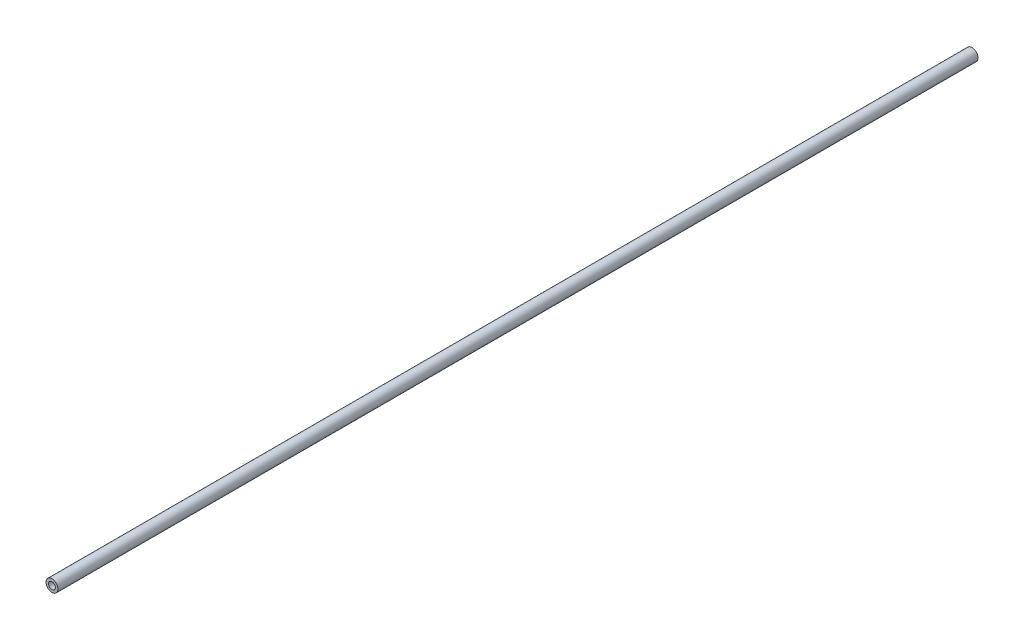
ISO-10303-21;
HEADER;
FILE_DESCRIPTION(('STEP AP214'),'2;1');
FILE_NAME('part.step','',(''),(''),'','','');
FILE_SCHEMA(('AUTOMOTIVE_DESIGN { 1 0 10303 214 1 1 1 1 }'));
ENDSEC;
DATA;
#1=APPLICATION_CONTEXT('core data for automotive mechanical design processes');
#2=APPLICATION_PROTOCOL_DEFINITION('international standard','automotive_design',2000,#1);
#3=PRODUCT_CONTEXT('',#1,'mechanical');
#4=PRODUCT('Part','Part','',(#3));
#5=PRODUCT_RELATED_PRODUCT_CATEGORY('part','',(#4));
#6=PRODUCT_DEFINITION_FORMATION('','',#4);
#7=PRODUCT_DEFINITION_CONTEXT('part definition',#1,'design');
#8=PRODUCT_DEFINITION('design','',#6,#7);
#9=PRODUCT_DEFINITION_SHAPE('','',#8);
#10=(LENGTH_UNIT() NAMED_UNIT(*) SI_UNIT(.MILLI.,.METRE.));
#11=(NAMED_UNIT(*) PLANE_ANGLE_UNIT() SI_UNIT($,.RADIAN.));
#12=(NAMED_UNIT(*) SI_UNIT($,.STERADIAN.) SOLID_ANGLE_UNIT());
#13=UNCERTAINTY_MEASURE_WITH_UNIT(LENGTH_MEASURE(1.E-05),#10,'distance_accuracy_value','');
#14=(GEOMETRIC_REPRESENTATION_CONTEXT(3) GLOBAL_UNCERTAINTY_ASSIGNED_CONTEXT((#13)) GLOBAL_UNIT_ASSIGNED_CONTEXT((#10,
#11,#12)) REPRESENTATION_CONTEXT('',''));
#15=CARTESIAN_POINT('',(0.,0.,0.));
#16=DIRECTION('',(0.,0.,1.));
#17=DIRECTION('',(1.,0.,0.));
#18=AXIS2_PLACEMENT_3D('',#15,#16,#17);
#19=CARTESIAN_POINT('',(0.,0.,462.5));
#20=DIRECTION('',(0.,0.,-1.));
#21=DIRECTION('',(-1.,0.,0.));
#22=AXIS2_PLACEMENT_3D('',#19,#20,#21);
#23=CYLINDRICAL_SURFACE('',#22,6.);
#24=CARTESIAN_POINT('',(0.,0.,462.5));
#25=DIRECTION('',(0.,0.,1.));
#26=DIRECTION('',(1.,0.,0.));
#27=AXIS2_PLACEMENT_3D('',#24,#25,#26);
#28=CIRCLE('',#27,6.);
#29=CARTESIAN_POINT('',(-6.00000000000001,0.,462.5));
#30=VERTEX_POINT('',#29);
#31=EDGE_CURVE('E11',#30,#30,#28,.T.);
#32=CARTESIAN_POINT('',(0.,0.,-462.5));
#33=DIRECTION('',(0.,0.,1.));
#34=DIRECTION('',(1.,0.,0.));
#35=AXIS2_PLACEMENT_3D('',#32,#33,#34);
#36=CIRCLE('',#35,6.);
#37=CARTESIAN_POINT('',(-6.00000000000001,0.,-462.5));
#38=VERTEX_POINT('',#37);
#39=EDGE_CURVE('E50',#38,#38,#36,.T.);
#40=CARTESIAN_POINT('',(-6.00000000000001,0.,462.5));
#41=CARTESIAN_POINT('',(-6.00000000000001,0.,452.864583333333));
#42=CARTESIAN_POINT('',(-6.00000000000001,0.,443.229166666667));
#43=CARTESIAN_POINT('',(-6.00000000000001,0.,423.958333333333));
#44=CARTESIAN_POINT('',(-6.00000000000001,0.,414.322916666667));
#45=CARTESIAN_POINT('',(-6.00000000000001,0.,395.052083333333));
#46=CARTESIAN_POINT('',(-6.00000000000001,0.,385.416666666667));
#47=CARTESIAN_POINT('',(-6.00000000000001,0.,366.145833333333));
#48=CARTESIAN_POINT('',(-6.00000000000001,0.,356.510416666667));
#49=CARTESIAN_POINT('',(-6.00000000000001,0.,337.239583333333));
#50=CARTESIAN_POINT('',(-6.00000000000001,0.,327.604166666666));
#51=CARTESIAN_POINT('',(-6.00000000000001,0.,308.333333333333));
#52=CARTESIAN_POINT('',(-6.00000000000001,0.,298.697916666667));
#53=CARTESIAN_POINT('',(-6.00000000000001,0.,279.427083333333));
#54=CARTESIAN_POINT('',(-6.00000000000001,0.,269.791666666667));
#55=CARTESIAN_POINT('',(-6.00000000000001,0.,250.520833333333));
#56=CARTESIAN_POINT('',(-6.00000000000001,0.,240.885416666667));
#57=CARTESIAN_POINT('',(-6.00000000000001,0.,221.614583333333));
#58=CARTESIAN_POINT('',(-6.00000000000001,0.,211.979166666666));
#59=CARTESIAN_POINT('',(-6.00000000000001,0.,192.708333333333));
#60=CARTESIAN_POINT('',(-6.00000000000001,0.,183.072916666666));
#61=CARTESIAN_POINT('',(-6.00000000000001,0.,163.802083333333));
#62=CARTESIAN_POINT('',(-6.00000000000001,0.,154.166666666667));
#63=CARTESIAN_POINT('',(-6.00000000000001,0.,134.895833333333));
#64=CARTESIAN_POINT('',(-6.00000000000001,0.,125.260416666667));
#65=CARTESIAN_POINT('',(-6.00000000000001,0.,105.989583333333));
#66=CARTESIAN_POINT('',(-6.00000000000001,0.,96.3541666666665));
#67=CARTESIAN_POINT('',(-6.00000000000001,0.,77.0833333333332));
#68=CARTESIAN_POINT('',(-6.00000000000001,0.,67.4479166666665));
#69=CARTESIAN_POINT('',(-6.00000000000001,0.,48.1770833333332));
#70=CARTESIAN_POINT('',(-6.00000000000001,0.,38.5416666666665));
#71=CARTESIAN_POINT('',(-6.00000000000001,0.,19.2708333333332));
#72=CARTESIAN_POINT('',(-6.00000000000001,0.,9.63541666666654));
#73=CARTESIAN_POINT('',(-6.00000000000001,0.,-9.63541666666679));
#74=CARTESIAN_POINT('',(-6.00000000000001,0.,-19.2708333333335));
#75=CARTESIAN_POINT('',(-6.00000000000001,0.,-38.5416666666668));
#76=CARTESIAN_POINT('',(-6.00000000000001,0.,-48.1770833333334));
#77=CARTESIAN_POINT('',(-6.00000000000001,0.,-67.4479166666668));
#78=CARTESIAN_POINT('',(-6.00000000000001,0.,-77.0833333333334));
#79=CARTESIAN_POINT('',(-6.00000000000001,0.,-96.3541666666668));
#80=CARTESIAN_POINT('',(-6.00000000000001,0.,-105.989583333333));
#81=CARTESIAN_POINT('',(-6.00000000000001,0.,-125.260416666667));
#82=CARTESIAN_POINT('',(-6.00000000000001,0.,-134.895833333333));
#83=CARTESIAN_POINT('',(-6.00000000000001,0.,-154.166666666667));
#84=CARTESIAN_POINT('',(-6.00000000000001,0.,-163.802083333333));
#85=CARTESIAN_POINT('',(-6.00000000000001,0.,-183.072916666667));
#86=CARTESIAN_POINT('',(-6.00000000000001,0.,-192.708333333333));
#87=CARTESIAN_POINT('',(-6.00000000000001,0.,-211.979166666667));
#88=CARTESIAN_POINT('',(-6.00000000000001,0.,-221.614583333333));
#89=CARTESIAN_POINT('',(-6.00000000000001,0.,-240.885416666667));
#90=CARTESIAN_POINT('',(-6.00000000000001,0.,-250.520833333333));
#91=CARTESIAN_POINT('',(-6.00000000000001,0.,-269.791666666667));
#92=CARTESIAN_POINT('',(-6.00000000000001,0.,-279.427083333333));
#93=CARTESIAN_POINT('',(-6.00000000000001,0.,-298.697916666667));
#94=CARTESIAN_POINT('',(-6.00000000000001,0.,-308.333333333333));
#95=CARTESIAN_POINT('',(-6.00000000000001,0.,-327.604166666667));
#96=CARTESIAN_POINT('',(-6.00000000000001,0.,-337.239583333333));
#97=CARTESIAN_POINT('',(-6.00000000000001,0.,-356.510416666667));
#98=CARTESIAN_POINT('',(-6.00000000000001,0.,-366.145833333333));
#99=CARTESIAN_POINT('',(-6.00000000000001,0.,-385.416666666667));
#100=CARTESIAN_POINT('',(-6.00000000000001,0.,-395.052083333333));
#101=CARTESIAN_POINT('',(-6.00000000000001,0.,-414.322916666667));
#102=CARTESIAN_POINT('',(-6.00000000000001,0.,-423.958333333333));
#103=CARTESIAN_POINT('',(-6.00000000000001,0.,-443.229166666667));
#104=CARTESIAN_POINT('',(-6.00000000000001,0.,-452.864583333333));
#105=CARTESIAN_POINT('',(-6.00000000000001,0.,-462.5));
#106=B_SPLINE_CURVE_WITH_KNOTS('',3,(#40,#41,#42,#43,#44,#45,#46,#47,#48,#49,#50,#51,#52,#53,
#54,#55,#56,#57,#58,#59,#60,#61,#62,#63,#64,#65,#66,#67,#68,#69,#70,#71,#72,#73,#74,#75,#76,#77,
#78,#79,#80,#81,#82,#83,#84,#85,#86,#87,#88,#89,#90,#91,#92,#93,#94,#95,#96,#97,#98,#99,#100,
#101,#102,#103,#104,#105),.UNSPECIFIED.,.F.,.F.,(4,2,2,2,2,2,2,2,2,2,2,2,2,2,2,2,2,2,2,2,2,2,2,
2,2,2,2,2,2,2,2,2,4),(0.,28.90625,57.8124999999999,86.71875,115.625,144.53125,173.4375,
202.34375,231.25,260.15625,289.0625,317.96875,346.875,375.78125,404.6875,433.59375,462.5,
491.40625,520.3125,549.21875,578.125,607.03125,635.9375,664.84375,693.75,722.65625,751.5625,
780.46875,809.375,838.28125,867.1875,896.09375,925.),.UNSPECIFIED.);
#107=EDGE_CURVE('BSEAM42',#30,#38,#106,.T.);
#108=ORIENTED_EDGE('',*,*,#31,.F.);
#109=ORIENTED_EDGE('',*,*,#39,.T.);
#110=ORIENTED_EDGE('',*,*,#107,.T.);
#111=ORIENTED_EDGE('',*,*,#107,.F.);
#112=EDGE_LOOP('',(#108,#110,#109,#111));
#113=FACE_BOUND('',#112,.T.);
#114=ADVANCED_FACE('F42',(#113),#23,.T.);
#115=CARTESIAN_POINT('',(0.,0.,462.5));
#116=DIRECTION('',(0.,0.,1.));
#117=DIRECTION('',(1.,0.,0.));
#118=AXIS2_PLACEMENT_3D('',#115,#116,#117);
#119=PLANE('',#118);
#120=CARTESIAN_POINT('',(0.,0.,462.5));
#121=DIRECTION('',(0.,0.,1.));
#122=DIRECTION('',(1.,0.,0.));
#123=AXIS2_PLACEMENT_3D('',#120,#121,#122);
#124=CIRCLE('',#123,3.39999999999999);
#125=CARTESIAN_POINT('',(3.39999999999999,0.,462.5));
#126=VERTEX_POINT('',#125);
#127=EDGE_CURVE('E66',#126,#126,#124,.T.);
#128=ORIENTED_EDGE('',*,*,#127,.F.);
#129=EDGE_LOOP('',(#128));
#130=FACE_BOUND('',#129,.T.);
#131=ORIENTED_EDGE('',*,*,#31,.T.);
#132=EDGE_LOOP('',(#131));
#133=FACE_BOUND('',#132,.T.);
#134=ADVANCED_FACE('F87',(#130,#133),#119,.T.);
#135=CARTESIAN_POINT('',(0.,0.,-462.5));
#136=DIRECTION('',(0.,0.,1.));
#137=DIRECTION('',(1.,0.,0.));
#138=AXIS2_PLACEMENT_3D('',#135,#136,#137);
#139=PLANE('',#138);
#140=CARTESIAN_POINT('',(0.,0.,-462.5));
#141=DIRECTION('',(0.,0.,-1.));
#142=DIRECTION('',(-1.,0.,0.));
#143=AXIS2_PLACEMENT_3D('',#140,#141,#142);
#144=CIRCLE('',#143,3.39999999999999);
#145=CARTESIAN_POINT('',(-3.39999999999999,0.,-462.5));
#146=VERTEX_POINT('',#145);
#147=EDGE_CURVE('E76',#146,#146,#144,.T.);
#148=ORIENTED_EDGE('',*,*,#147,.F.);
#149=EDGE_LOOP('',(#148));
#150=FACE_BOUND('',#149,.T.);
#151=ORIENTED_EDGE('',*,*,#39,.F.);
#152=EDGE_LOOP('',(#151));
#153=FACE_BOUND('',#152,.T.);
#154=ADVANCED_FACE('F84',(#150,#153),#139,.F.);
#155=CARTESIAN_POINT('',(0.,0.,-462.5));
#156=DIRECTION('',(0.,0.,-1.));
#157=DIRECTION('',(-1.,0.,0.));
#158=AXIS2_PLACEMENT_3D('',#155,#156,#157);
#159=CYLINDRICAL_SURFACE('',#158,3.39999999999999);
#160=CARTESIAN_POINT('',(0.,0.,-442.75));
#161=DIRECTION('',(0.,0.,-1.));
#162=DIRECTION('',(-1.,0.,0.));
#163=AXIS2_PLACEMENT_3D('',#160,#161,#162);
#164=CIRCLE('',#163,3.4);
#165=CARTESIAN_POINT('',(-3.39999999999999,0.,-442.75));
#166=VERTEX_POINT('',#165);
#167=EDGE_CURVE('E71',#166,#166,#164,.T.);
#168=CARTESIAN_POINT('',(-3.39999999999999,0.,-442.75));
#169=CARTESIAN_POINT('',(-3.39999999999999,0.,-442.955729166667));
#170=CARTESIAN_POINT('',(-3.39999999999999,0.,-443.161458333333));
#171=CARTESIAN_POINT('',(-3.39999999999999,0.,-443.572916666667));
#172=CARTESIAN_POINT('',(-3.39999999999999,0.,-443.778645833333));
#173=CARTESIAN_POINT('',(-3.39999999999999,0.,-444.190104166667));
#174=CARTESIAN_POINT('',(-3.39999999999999,0.,-444.395833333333));
#175=CARTESIAN_POINT('',(-3.39999999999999,0.,-444.807291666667));
#176=CARTESIAN_POINT('',(-3.39999999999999,0.,-445.013020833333));
#177=CARTESIAN_POINT('',(-3.39999999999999,0.,-445.424479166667));
#178=CARTESIAN_POINT('',(-3.39999999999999,0.,-445.630208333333));
#179=CARTESIAN_POINT('',(-3.39999999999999,0.,-446.041666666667));
#180=CARTESIAN_POINT('',(-3.39999999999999,0.,-446.247395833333));
#181=CARTESIAN_POINT('',(-3.39999999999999,0.,-446.658854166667));
#182=CARTESIAN_POINT('',(-3.39999999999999,0.,-446.864583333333));
#183=CARTESIAN_POINT('',(-3.39999999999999,0.,-447.276041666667));
#184=CARTESIAN_POINT('',(-3.39999999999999,0.,-447.481770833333));
#185=CARTESIAN_POINT('',(-3.39999999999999,0.,-447.893229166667));
#186=CARTESIAN_POINT('',(-3.39999999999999,0.,-448.098958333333));
#187=CARTESIAN_POINT('',(-3.39999999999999,0.,-448.510416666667));
#188=CARTESIAN_POINT('',(-3.39999999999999,0.,-448.716145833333));
#189=CARTESIAN_POINT('',(-3.39999999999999,0.,-449.127604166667));
#190=CARTESIAN_POINT('',(-3.39999999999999,0.,-449.333333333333));
#191=CARTESIAN_POINT('',(-3.39999999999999,0.,-449.744791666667));
#192=CARTESIAN_POINT('',(-3.39999999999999,0.,-449.950520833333));
#193=CARTESIAN_POINT('',(-3.39999999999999,0.,-450.361979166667));
#194=CARTESIAN_POINT('',(-3.39999999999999,0.,-450.567708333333));
#195=CARTESIAN_POINT('',(-3.39999999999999,0.,-450.979166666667));
#196=CARTESIAN_POINT('',(-3.39999999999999,0.,-451.184895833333));
#197=CARTESIAN_POINT('',(-3.39999999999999,0.,-451.596354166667));
#198=CARTESIAN_POINT('',(-3.39999999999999,0.,-451.802083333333));
#199=CARTESIAN_POINT('',(-3.39999999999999,0.,-452.213541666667));
#200=CARTESIAN_POINT('',(-3.39999999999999,0.,-452.419270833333));
#201=CARTESIAN_POINT('',(-3.39999999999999,0.,-452.830729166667));
#202=CARTESIAN_POINT('',(-3.39999999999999,0.,-453.036458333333));
#203=CARTESIAN_POINT('',(-3.39999999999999,0.,-453.447916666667));
#204=CARTESIAN_POINT('',(-3.39999999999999,0.,-453.653645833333));
#205=CARTESIAN_POINT('',(-3.39999999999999,0.,-454.065104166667));
#206=CARTESIAN_POINT('',(-3.39999999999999,0.,-454.270833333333));
#207=CARTESIAN_POINT('',(-3.39999999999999,0.,-454.682291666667));
#208=CARTESIAN_POINT('',(-3.39999999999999,0.,-454.888020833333));
#209=CARTESIAN_POINT('',(-3.39999999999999,0.,-455.299479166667));
#210=CARTESIAN_POINT('',(-3.39999999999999,0.,-455.505208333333));
#211=CARTESIAN_POINT('',(-3.39999999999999,0.,-455.916666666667));
#212=CARTESIAN_POINT('',(-3.39999999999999,0.,-456.122395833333));
#213=CARTESIAN_POINT('',(-3.39999999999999,0.,-456.533854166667));
#214=CARTESIAN_POINT('',(-3.39999999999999,0.,-456.739583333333));
#215=CARTESIAN_POINT('',(-3.39999999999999,0.,-457.151041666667));
#216=CARTESIAN_POINT('',(-3.39999999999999,0.,-457.356770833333));
#217=CARTESIAN_POINT('',(-3.39999999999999,0.,-457.768229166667));
#218=CARTESIAN_POINT('',(-3.39999999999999,0.,-457.973958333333));
#219=CARTESIAN_POINT('',(-3.39999999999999,0.,-458.385416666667));
#220=CARTESIAN_POINT('',(-3.39999999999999,0.,-458.591145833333));
#221=CARTESIAN_POINT('',(-3.39999999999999,0.,-459.002604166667));
#222=CARTESIAN_POINT('',(-3.39999999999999,0.,-459.208333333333));
#223=CARTESIAN_POINT('',(-3.39999999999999,0.,-459.619791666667));
#224=CARTESIAN_POINT('',(-3.39999999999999,0.,-459.825520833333));
#225=CARTESIAN_POINT('',(-3.39999999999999,0.,-460.236979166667));
#226=CARTESIAN_POINT('',(-3.39999999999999,0.,-460.442708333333));
#227=CARTESIAN_POINT('',(-3.39999999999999,0.,-460.854166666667));
#228=CARTESIAN_POINT('',(-3.39999999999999,0.,-461.059895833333));
#229=CARTESIAN_POINT('',(-3.39999999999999,0.,-461.471354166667));
#230=CARTESIAN_POINT('',(-3.39999999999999,0.,-461.677083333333));
#231=CARTESIAN_POINT('',(-3.39999999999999,0.,-462.088541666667));
#232=CARTESIAN_POINT('',(-3.39999999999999,0.,-462.294270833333));
#233=CARTESIAN_POINT('',(-3.39999999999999,0.,-462.5));
#234=B_SPLINE_CURVE_WITH_KNOTS('',3,(#168,#169,#170,#171,#172,#173,#174,#175,#176,#177,#178,
#179,#180,#181,#182,#183,#184,#185,#186,#187,#188,#189,#190,#191,#192,#193,#194,#195,#196,#197,
#198,#199,#200,#201,#202,#203,#204,#205,#206,#207,#208,#209,#210,#211,#212,#213,#214,#215,#216,
#217,#218,#219,#220,#221,#222,#223,#224,#225,#226,#227,#228,#229,#230,#231,#232,#233),
.UNSPECIFIED.,.F.,.F.,(4,2,2,2,2,2,2,2,2,2,2,2,2,2,2,2,2,2,2,2,2,2,2,2,2,2,2,2,2,2,2,2,4),(0.,
0.617187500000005,1.23437500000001,1.85156250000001,2.46875000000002,3.08593750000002,
3.70312500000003,4.32031250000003,4.93750000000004,5.55468749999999,6.17187499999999,6.7890625,
7.40625,8.02343750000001,8.64062500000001,9.25781250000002,9.87499999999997,10.4921875,
11.109375,11.7265625,12.34375,12.9609375,13.578125,14.1953125,14.8125,15.4296875,16.046875,
16.6640625,17.28125,17.8984375,18.515625,19.1328125,19.75),.UNSPECIFIED.);
#235=EDGE_CURVE('BSEAM86',#166,#146,#234,.T.);
#236=ORIENTED_EDGE('',*,*,#167,.F.);
#237=ORIENTED_EDGE('',*,*,#147,.T.);
#238=ORIENTED_EDGE('',*,*,#235,.T.);
#239=ORIENTED_EDGE('',*,*,#235,.F.);
#240=EDGE_LOOP('',(#236,#238,#237,#239));
#241=FACE_BOUND('',#240,.T.);
#242=ADVANCED_FACE('F86',(#241),#159,.F.);
#243=CARTESIAN_POINT('',(0.,0.,-442.75));
#244=DIRECTION('',(0.,0.,-1.));
#245=DIRECTION('',(-1.,0.,0.));
#246=AXIS2_PLACEMENT_3D('',#243,#244,#245);
#247=CONICAL_SURFACE('',#246,3.4,1.02974425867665);
#248=CARTESIAN_POINT('',(0.,0.,-440.707073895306));
#249=VERTEX_POINT('',#248);
#250=VERTEX_LOOP('',#249);
#251=FACE_BOUND('',#250,.T.);
#252=ORIENTED_EDGE('',*,*,#167,.T.);
#253=EDGE_LOOP('',(#252));
#254=FACE_BOUND('',#253,.T.);
#255=ADVANCED_FACE('F94',(#251,#254),#247,.F.);
#256=CARTESIAN_POINT('',(0.,0.,462.5));
#257=DIRECTION('',(0.,0.,1.));
#258=DIRECTION('',(1.,0.,0.));
#259=AXIS2_PLACEMENT_3D('',#256,#257,#258);
#260=CYLINDRICAL_SURFACE('',#259,3.39999999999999);
#261=CARTESIAN_POINT('',(0.,0.,442.75));
#262=DIRECTION('',(0.,0.,1.));
#263=DIRECTION('',(1.,0.,0.));
#264=AXIS2_PLACEMENT_3D('',#261,#262,#263);
#265=CIRCLE('',#264,3.4);
#266=CARTESIAN_POINT('',(3.39999999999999,0.,442.75));
#267=VERTEX_POINT('',#266);
#268=EDGE_CURVE('E63',#267,#267,#265,.T.);
#269=CARTESIAN_POINT('',(3.39999999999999,0.,442.75));
#270=CARTESIAN_POINT('',(3.39999999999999,0.,442.955729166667));
#271=CARTESIAN_POINT('',(3.39999999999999,0.,443.161458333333));
#272=CARTESIAN_POINT('',(3.39999999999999,0.,443.572916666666));
#273=CARTESIAN_POINT('',(3.39999999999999,0.,443.778645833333));
#274=CARTESIAN_POINT('',(3.39999999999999,0.,444.190104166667));
#275=CARTESIAN_POINT('',(3.39999999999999,0.,444.395833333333));
#276=CARTESIAN_POINT('',(3.39999999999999,0.,444.807291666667));
#277=CARTESIAN_POINT('',(3.39999999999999,0.,445.013020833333));
#278=CARTESIAN_POINT('',(3.39999999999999,0.,445.424479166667));
#279=CARTESIAN_POINT('',(3.39999999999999,0.,445.630208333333));
#280=CARTESIAN_POINT('',(3.39999999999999,0.,446.041666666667));
#281=CARTESIAN_POINT('',(3.39999999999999,0.,446.247395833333));
#282=CARTESIAN_POINT('',(3.39999999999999,0.,446.658854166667));
#283=CARTESIAN_POINT('',(3.39999999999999,0.,446.864583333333));
#284=CARTESIAN_POINT('',(3.39999999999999,0.,447.276041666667));
#285=CARTESIAN_POINT('',(3.39999999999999,0.,447.481770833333));
#286=CARTESIAN_POINT('',(3.39999999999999,0.,447.893229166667));
#287=CARTESIAN_POINT('',(3.39999999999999,0.,448.098958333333));
#288=CARTESIAN_POINT('',(3.39999999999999,0.,448.510416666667));
#289=CARTESIAN_POINT('',(3.39999999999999,0.,448.716145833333));
#290=CARTESIAN_POINT('',(3.39999999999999,0.,449.127604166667));
#291=CARTESIAN_POINT('',(3.39999999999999,0.,449.333333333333));
#292=CARTESIAN_POINT('',(3.39999999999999,0.,449.744791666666));
#293=CARTESIAN_POINT('',(3.39999999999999,0.,449.950520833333));
#294=CARTESIAN_POINT('',(3.39999999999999,0.,450.361979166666));
#295=CARTESIAN_POINT('',(3.39999999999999,0.,450.567708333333));
#296=CARTESIAN_POINT('',(3.39999999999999,0.,450.979166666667));
#297=CARTESIAN_POINT('',(3.39999999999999,0.,451.184895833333));
#298=CARTESIAN_POINT('',(3.39999999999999,0.,451.596354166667));
#299=CARTESIAN_POINT('',(3.39999999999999,0.,451.802083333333));
#300=CARTESIAN_POINT('',(3.39999999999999,0.,452.213541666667));
#301=CARTESIAN_POINT('',(3.39999999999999,0.,452.419270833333));
#302=CARTESIAN_POINT('',(3.39999999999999,0.,452.830729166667));
#303=CARTESIAN_POINT('',(3.39999999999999,0.,453.036458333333));
#304=CARTESIAN_POINT('',(3.39999999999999,0.,453.447916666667));
#305=CARTESIAN_POINT('',(3.39999999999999,0.,453.653645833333));
#306=CARTESIAN_POINT('',(3.39999999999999,0.,454.065104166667));
#307=CARTESIAN_POINT('',(3.39999999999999,0.,454.270833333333));
#308=CARTESIAN_POINT('',(3.39999999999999,0.,454.682291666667));
#309=CARTESIAN_POINT('',(3.39999999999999,0.,454.888020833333));
#310=CARTESIAN_POINT('',(3.39999999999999,0.,455.299479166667));
#311=CARTESIAN_POINT('',(3.39999999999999,0.,455.505208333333));
#312=CARTESIAN_POINT('',(3.39999999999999,0.,455.916666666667));
#313=CARTESIAN_POINT('',(3.39999999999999,0.,456.122395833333));
#314=CARTESIAN_POINT('',(3.39999999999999,0.,456.533854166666));
#315=CARTESIAN_POINT('',(3.39999999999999,0.,456.739583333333));
#316=CARTESIAN_POINT('',(3.39999999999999,0.,457.151041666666));
#317=CARTESIAN_POINT('',(3.39999999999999,0.,457.356770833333));
#318=CARTESIAN_POINT('',(3.39999999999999,0.,457.768229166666));
#319=CARTESIAN_POINT('',(3.39999999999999,0.,457.973958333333));
#320=CARTESIAN_POINT('',(3.39999999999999,0.,458.385416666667));
#321=CARTESIAN_POINT('',(3.39999999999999,0.,458.591145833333));
#322=CARTESIAN_POINT('',(3.39999999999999,0.,459.002604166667));
#323=CARTESIAN_POINT('',(3.39999999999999,0.,459.208333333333));
#324=CARTESIAN_POINT('',(3.39999999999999,0.,459.619791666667));
#325=CARTESIAN_POINT('',(3.39999999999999,0.,459.825520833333));
#326=CARTESIAN_POINT('',(3.39999999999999,0.,460.236979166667));
#327=CARTESIAN_POINT('',(3.39999999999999,0.,460.442708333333));
#328=CARTESIAN_POINT('',(3.39999999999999,0.,460.854166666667));
#329=CARTESIAN_POINT('',(3.39999999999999,0.,461.059895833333));
#330=CARTESIAN_POINT('',(3.39999999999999,0.,461.471354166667));
#331=CARTESIAN_POINT('',(3.39999999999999,0.,461.677083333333));
#332=CARTESIAN_POINT('',(3.39999999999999,0.,462.088541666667));
#333=CARTESIAN_POINT('',(3.39999999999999,0.,462.294270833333));
#334=CARTESIAN_POINT('',(3.39999999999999,0.,462.5));
#335=B_SPLINE_CURVE_WITH_KNOTS('',3,(#269,#270,#271,#272,#273,#274,#275,#276,#277,#278,#279,
#280,#281,#282,#283,#284,#285,#286,#287,#288,#289,#290,#291,#292,#293,#294,#295,#296,#297,#298,
#299,#300,#301,#302,#303,#304,#305,#306,#307,#308,#309,#310,#311,#312,#313,#314,#315,#316,#317,
#318,#319,#320,#321,#322,#323,#324,#325,#326,#327,#328,#329,#330,#331,#332,#333,#334),
.UNSPECIFIED.,.F.,.F.,(4,2,2,2,2,2,2,2,2,2,2,2,2,2,2,2,2,2,2,2,2,2,2,2,2,2,2,2,2,2,2,2,4),(0.,
0.617187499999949,1.23437499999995,1.85156249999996,2.46874999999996,3.08593749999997,
3.70312499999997,4.32031249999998,4.93749999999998,5.55468749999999,6.17187499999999,
6.78906249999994,7.40624999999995,8.02343749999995,8.64062499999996,9.25781249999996,
9.87499999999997,10.4921875,11.109375,11.7265625,12.34375,12.9609375,13.5781249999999,
14.1953124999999,14.8125,15.4296875,16.046875,16.6640625,17.28125,17.8984375,18.515625,
19.1328125,19.75),.UNSPECIFIED.);
#336=EDGE_CURVE('BSEAM59',#267,#126,#335,.T.);
#337=ORIENTED_EDGE('',*,*,#268,.F.);
#338=ORIENTED_EDGE('',*,*,#127,.T.);
#339=ORIENTED_EDGE('',*,*,#336,.T.);
#340=ORIENTED_EDGE('',*,*,#336,.F.);
#341=EDGE_LOOP('',(#337,#339,#338,#340));
#342=FACE_BOUND('',#341,.T.);
#343=ADVANCED_FACE('F59',(#342),#260,.F.);
#344=CARTESIAN_POINT('',(0.,0.,442.75));
#345=DIRECTION('',(0.,0.,1.));
#346=DIRECTION('',(1.,0.,0.));
#347=AXIS2_PLACEMENT_3D('',#344,#345,#346);
#348=CONICAL_SURFACE('',#347,3.4,1.02974425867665);
#349=CARTESIAN_POINT('',(0.,0.,440.707073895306));
#350=VERTEX_POINT('',#349);
#351=VERTEX_LOOP('',#350);
#352=FACE_BOUND('',#351,.T.);
#353=ORIENTED_EDGE('',*,*,#268,.T.);
#354=EDGE_LOOP('',(#353));
#355=FACE_BOUND('',#354,.T.);
#356=ADVANCED_FACE('F56',(#352,#355),#348,.F.);
#357=CLOSED_SHELL('',(#114,#134,#154,#242,#255,#343,#356));
#358=MANIFOLD_SOLID_BREP('B2',#357);
#359=ADVANCED_BREP_SHAPE_REPRESENTATION('',(#18,#358),#14);
#360=SHAPE_DEFINITION_REPRESENTATION(#9,#359);
ENDSEC;
END-ISO-10303-21;
